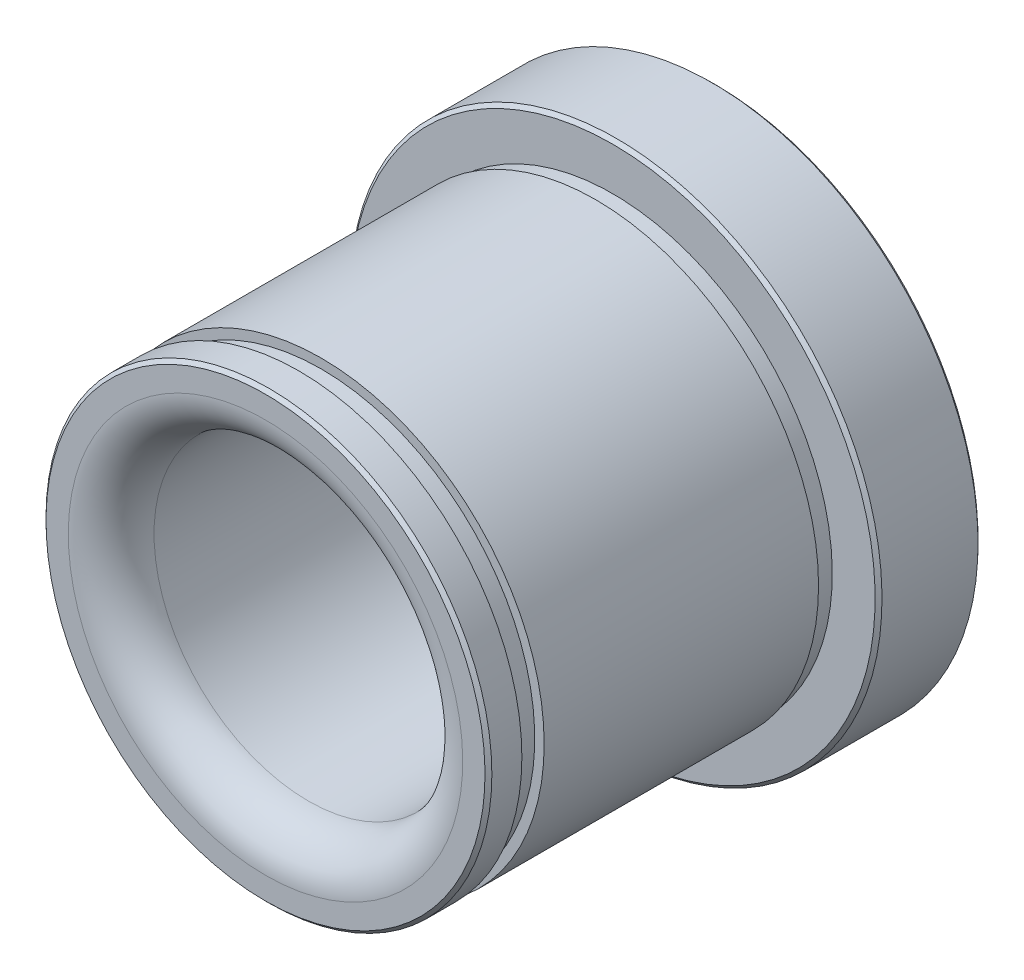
from build123d import *

# Parameters (mm, degrees)
SKETCH2_W = 1.3
SKETCH2_H = 0.55


with BuildPart() as part:
    # Sketch1 → Revolve1 (revolve)
    with BuildSketch(Plane(origin=(0, 0, 0), x_dir=(0, 0, -1), z_dir=(1, 0, 0)), mode=Mode.PRIVATE) as revolve1_sk:
        with BuildLine():
            Line((-26.5, 12.8), (-26.3, 13))
            Line((-26.3, 13), (-7.25, 13))
            Line((-7.25, 13), (-7.25, 12.8))
            Line((-7.25, 12.8), (-6.25, 12.8))
            Line((-6.25, 12.8), (-6.25, 15.3))
            Line((-6.25, 15.3), (-6.05, 15.5))
            Line((-6.05, 15.5), (-0.45, 15.5))
            Line((-0.45, 15.5), (-0.25, 15.3))
            Line((-0.25, 15.3), (-0.25, 10.5))
            Line((-0.25, 10.5), (-1.75, 9))
            Line((-1.75, 9), (-24, 9))
            ThreePointArc((-24, 9), (-25.767766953, 9.732233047), (-26.5, 11.5))
            Line((-26.5, 11.5), (-26.5, 12.8))
        make_face()
    revolve(revolve1_sk.sketch.rotate(Axis((0, 0, 26.5), (0, 0, -1)), 180), axis=Axis((0, 0, 26.5), (0, 0, -1)))

    # Sketch2 → Cut-Revolve1 (revolve, cut)
    with BuildSketch(Plane(origin=(0, 0, 0), x_dir=(0, 0, -1), z_dir=(1, 0, 0)), mode=Mode.PRIVATE) as cut_revolve1_sk:
        with Locations((-23.9, 12.725)):
            Rectangle(SKETCH2_W, SKETCH2_H)
    revolve(cut_revolve1_sk.sketch.rotate(Axis((0, 0, 26.5), (0, 0, -1)), 180), axis=Axis((0, 0, 26.5), (0, 0, -1)), mode=Mode.SUBTRACT)


solid = part.part
